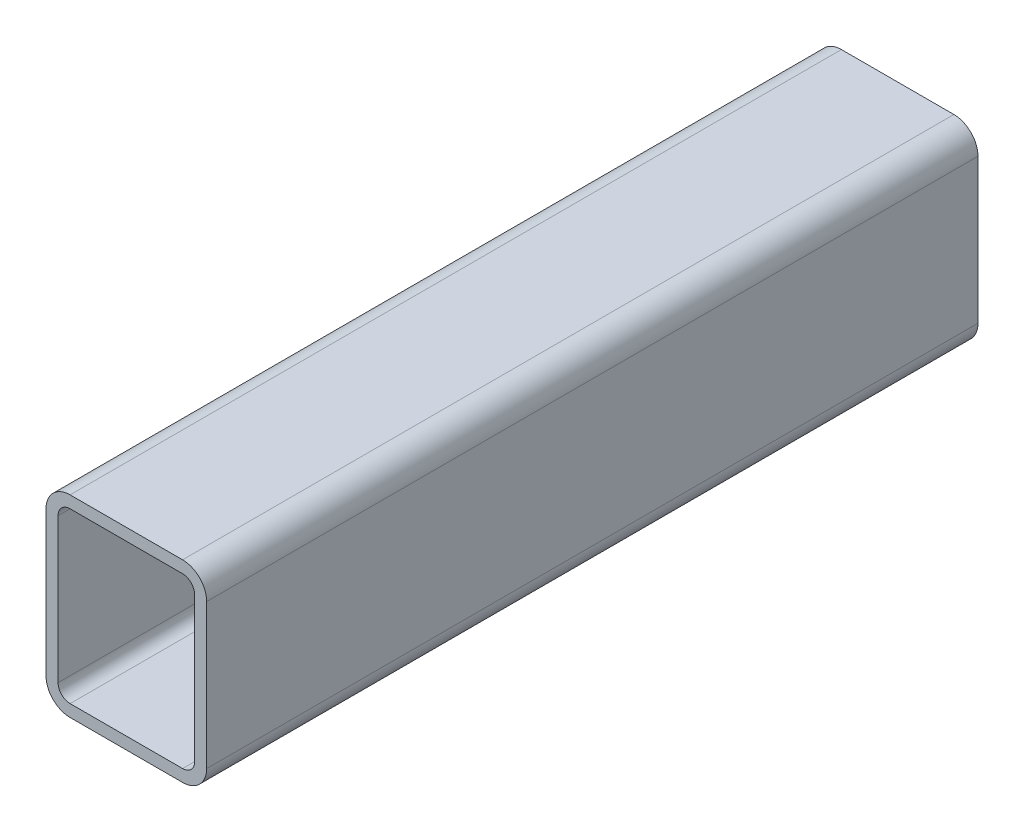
ISO-10303-21;
HEADER;
FILE_DESCRIPTION(('STEP AP214'),'2;1');
FILE_NAME('part.step','',(''),(''),'','','');
FILE_SCHEMA(('AUTOMOTIVE_DESIGN { 1 0 10303 214 1 1 1 1 }'));
ENDSEC;
DATA;
#1=APPLICATION_CONTEXT('core data for automotive mechanical design processes');
#2=APPLICATION_PROTOCOL_DEFINITION('international standard','automotive_design',2000,#1);
#3=PRODUCT_CONTEXT('',#1,'mechanical');
#4=PRODUCT('Part','Part','',(#3));
#5=PRODUCT_RELATED_PRODUCT_CATEGORY('part','',(#4));
#6=PRODUCT_DEFINITION_FORMATION('','',#4);
#7=PRODUCT_DEFINITION_CONTEXT('part definition',#1,'design');
#8=PRODUCT_DEFINITION('design','',#6,#7);
#9=PRODUCT_DEFINITION_SHAPE('','',#8);
#10=(LENGTH_UNIT() NAMED_UNIT(*) SI_UNIT(.MILLI.,.METRE.));
#11=(NAMED_UNIT(*) PLANE_ANGLE_UNIT() SI_UNIT($,.RADIAN.));
#12=(NAMED_UNIT(*) SI_UNIT($,.STERADIAN.) SOLID_ANGLE_UNIT());
#13=UNCERTAINTY_MEASURE_WITH_UNIT(LENGTH_MEASURE(1.E-05),#10,'distance_accuracy_value','');
#14=(GEOMETRIC_REPRESENTATION_CONTEXT(3) GLOBAL_UNCERTAINTY_ASSIGNED_CONTEXT((#13)) GLOBAL_UNIT_ASSIGNED_CONTEXT((#10,
#11,#12)) REPRESENTATION_CONTEXT('',''));
#15=CARTESIAN_POINT('',(0.,0.,0.));
#16=DIRECTION('',(0.,0.,1.));
#17=DIRECTION('',(1.,0.,0.));
#18=AXIS2_PLACEMENT_3D('',#15,#16,#17);
#19=CARTESIAN_POINT('',(12.4210851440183,68.7556737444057,304.8));
#20=DIRECTION('',(0.,0.,1.));
#21=DIRECTION('',(1.,0.,0.));
#22=AXIS2_PLACEMENT_3D('',#19,#20,#21);
#23=PLANE('',#22);
#24=CARTESIAN_POINT('',(12.4210851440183,68.7556737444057,304.8));
#25=DIRECTION('',(0.,0.,1.));
#26=DIRECTION('',(1.,0.,0.));
#27=AXIS2_PLACEMENT_3D('',#24,#25,#26);
#28=CIRCLE('',#27,9.525);
#29=CARTESIAN_POINT('',(12.4210851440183,78.2806737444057,304.8));
#30=VERTEX_POINT('',#29);
#31=CARTESIAN_POINT('',(2.89608514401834,68.7556737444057,304.8));
#32=VERTEX_POINT('',#31);
#33=EDGE_CURVE('E211',#30,#32,#28,.T.);
#34=ORIENTED_EDGE('',*,*,#33,.T.);
#35=DIRECTION('',(0.,-1.,0.));
#36=VECTOR('',#35,1.);
#37=CARTESIAN_POINT('',(2.89608514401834,11.6056737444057,304.8));
#38=LINE('',#37,#36);
#39=CARTESIAN_POINT('',(2.89608514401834,11.6056737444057,304.8));
#40=VERTEX_POINT('',#39);
#41=EDGE_CURVE('E214',#32,#40,#38,.T.);
#42=ORIENTED_EDGE('',*,*,#41,.T.);
#43=CARTESIAN_POINT('',(12.4210851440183,11.6056737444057,304.8));
#44=DIRECTION('',(0.,0.,1.));
#45=DIRECTION('',(1.,0.,0.));
#46=AXIS2_PLACEMENT_3D('',#43,#44,#45);
#47=CIRCLE('',#46,9.525);
#48=CARTESIAN_POINT('',(12.4210851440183,2.0806737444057,304.8));
#49=VERTEX_POINT('',#48);
#50=EDGE_CURVE('E217',#40,#49,#47,.T.);
#51=ORIENTED_EDGE('',*,*,#50,.T.);
#52=DIRECTION('',(1.,0.,0.));
#53=VECTOR('',#52,1.);
#54=CARTESIAN_POINT('',(56.8710851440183,2.0806737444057,304.8));
#55=LINE('',#54,#53);
#56=CARTESIAN_POINT('',(56.8710851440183,2.0806737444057,304.8));
#57=VERTEX_POINT('',#56);
#58=EDGE_CURVE('E219',#49,#57,#55,.T.);
#59=ORIENTED_EDGE('',*,*,#58,.T.);
#60=CARTESIAN_POINT('',(56.8710851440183,11.6056737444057,304.8));
#61=DIRECTION('',(0.,0.,1.));
#62=DIRECTION('',(1.,0.,0.));
#63=AXIS2_PLACEMENT_3D('',#60,#61,#62);
#64=CIRCLE('',#63,9.525);
#65=CARTESIAN_POINT('',(66.3960851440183,11.6056737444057,304.8));
#66=VERTEX_POINT('',#65);
#67=EDGE_CURVE('E221',#57,#66,#64,.T.);
#68=ORIENTED_EDGE('',*,*,#67,.T.);
#69=DIRECTION('',(0.,1.,0.));
#70=VECTOR('',#69,1.);
#71=CARTESIAN_POINT('',(66.3960851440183,68.7556737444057,304.8));
#72=LINE('',#71,#70);
#73=CARTESIAN_POINT('',(66.3960851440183,68.7556737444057,304.8));
#74=VERTEX_POINT('',#73);
#75=EDGE_CURVE('E223',#66,#74,#72,.T.);
#76=ORIENTED_EDGE('',*,*,#75,.T.);
#77=CARTESIAN_POINT('',(56.8710851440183,68.7556737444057,304.8));
#78=DIRECTION('',(0.,0.,1.));
#79=DIRECTION('',(1.,0.,0.));
#80=AXIS2_PLACEMENT_3D('',#77,#78,#79);
#81=CIRCLE('',#80,9.525);
#82=CARTESIAN_POINT('',(56.8710851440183,78.2806737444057,304.8));
#83=VERTEX_POINT('',#82);
#84=EDGE_CURVE('E225',#74,#83,#81,.T.);
#85=ORIENTED_EDGE('',*,*,#84,.T.);
#86=DIRECTION('',(-1.,0.,0.));
#87=VECTOR('',#86,1.);
#88=CARTESIAN_POINT('',(12.4210851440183,78.2806737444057,304.8));
#89=LINE('',#88,#87);
#90=EDGE_CURVE('E227',#83,#30,#89,.T.);
#91=ORIENTED_EDGE('',*,*,#90,.T.);
#92=EDGE_LOOP('',(#34,#42,#51,#59,#68,#76,#85,#91));
#93=FACE_BOUND('',#92,.T.);
#94=DIRECTION('',(0.,-1.,0.));
#95=VECTOR('',#94,1.);
#96=CARTESIAN_POINT('',(7.65858514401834,11.6056737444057,304.8));
#97=LINE('',#96,#95);
#98=CARTESIAN_POINT('',(7.65858514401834,68.7556737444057,304.8));
#99=VERTEX_POINT('',#98);
#100=CARTESIAN_POINT('',(7.65858514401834,11.6056737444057,304.8));
#101=VERTEX_POINT('',#100);
#102=EDGE_CURVE('E154',#99,#101,#97,.T.);
#103=ORIENTED_EDGE('',*,*,#102,.F.);
#104=CARTESIAN_POINT('',(12.4210851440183,68.7556737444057,304.8));
#105=DIRECTION('',(0.,0.,1.));
#106=DIRECTION('',(1.,0.,0.));
#107=AXIS2_PLACEMENT_3D('',#104,#105,#106);
#108=CIRCLE('',#107,4.76249999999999);
#109=CARTESIAN_POINT('',(12.4210851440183,73.5181737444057,304.8));
#110=VERTEX_POINT('',#109);
#111=EDGE_CURVE('E146',#110,#99,#108,.T.);
#112=ORIENTED_EDGE('',*,*,#111,.F.);
#113=DIRECTION('',(-1.,0.,0.));
#114=VECTOR('',#113,1.);
#115=CARTESIAN_POINT('',(12.4210851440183,73.5181737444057,304.8));
#116=LINE('',#115,#114);
#117=CARTESIAN_POINT('',(56.8710851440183,73.5181737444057,304.8));
#118=VERTEX_POINT('',#117);
#119=EDGE_CURVE('E179',#118,#110,#116,.T.);
#120=ORIENTED_EDGE('',*,*,#119,.F.);
#121=CARTESIAN_POINT('',(56.8710851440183,68.7556737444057,304.8));
#122=DIRECTION('',(0.,0.,1.));
#123=DIRECTION('',(1.,0.,0.));
#124=AXIS2_PLACEMENT_3D('',#121,#122,#123);
#125=CIRCLE('',#124,4.7625);
#126=CARTESIAN_POINT('',(61.6335851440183,68.7556737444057,304.8));
#127=VERTEX_POINT('',#126);
#128=EDGE_CURVE('E177',#127,#118,#125,.T.);
#129=ORIENTED_EDGE('',*,*,#128,.F.);
#130=DIRECTION('',(0.,1.,0.));
#131=VECTOR('',#130,1.);
#132=CARTESIAN_POINT('',(61.6335851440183,68.7556737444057,304.8));
#133=LINE('',#132,#131);
#134=CARTESIAN_POINT('',(61.6335851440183,11.6056737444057,304.8));
#135=VERTEX_POINT('',#134);
#136=EDGE_CURVE('E175',#135,#127,#133,.T.);
#137=ORIENTED_EDGE('',*,*,#136,.F.);
#138=CARTESIAN_POINT('',(56.8710851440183,11.6056737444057,304.8));
#139=DIRECTION('',(0.,0.,1.));
#140=DIRECTION('',(1.,0.,0.));
#141=AXIS2_PLACEMENT_3D('',#138,#139,#140);
#142=CIRCLE('',#141,4.7625);
#143=CARTESIAN_POINT('',(56.8710851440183,6.8431737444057,304.8));
#144=VERTEX_POINT('',#143);
#145=EDGE_CURVE('E173',#144,#135,#142,.T.);
#146=ORIENTED_EDGE('',*,*,#145,.F.);
#147=DIRECTION('',(1.,0.,0.));
#148=VECTOR('',#147,1.);
#149=CARTESIAN_POINT('',(56.8710851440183,6.8431737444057,304.8));
#150=LINE('',#149,#148);
#151=CARTESIAN_POINT('',(12.4210851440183,6.8431737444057,304.8));
#152=VERTEX_POINT('',#151);
#153=EDGE_CURVE('E169',#152,#144,#150,.T.);
#154=ORIENTED_EDGE('',*,*,#153,.F.);
#155=CARTESIAN_POINT('',(12.4210851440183,11.6056737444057,304.8));
#156=DIRECTION('',(0.,0.,1.));
#157=DIRECTION('',(1.,0.,0.));
#158=AXIS2_PLACEMENT_3D('',#155,#156,#157);
#159=CIRCLE('',#158,4.7625);
#160=EDGE_CURVE('E167',#101,#152,#159,.T.);
#161=ORIENTED_EDGE('',*,*,#160,.F.);
#162=EDGE_LOOP('',(#103,#112,#120,#129,#137,#146,#154,#161));
#163=FACE_BOUND('',#162,.T.);
#164=ADVANCED_FACE('F33',(#93,#163),#23,.T.);
#165=CARTESIAN_POINT('',(12.4210851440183,68.7556737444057,0.));
#166=DIRECTION('',(0.,0.,1.));
#167=DIRECTION('',(1.,0.,0.));
#168=AXIS2_PLACEMENT_3D('',#165,#166,#167);
#169=PLANE('',#168);
#170=CARTESIAN_POINT('',(12.4210851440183,68.7556737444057,0.));
#171=DIRECTION('',(0.,0.,1.));
#172=DIRECTION('',(1.,0.,0.));
#173=AXIS2_PLACEMENT_3D('',#170,#171,#172);
#174=CIRCLE('',#173,9.525);
#175=CARTESIAN_POINT('',(12.4210851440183,78.2806737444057,0.));
#176=VERTEX_POINT('',#175);
#177=CARTESIAN_POINT('',(2.89608514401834,68.7556737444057,0.));
#178=VERTEX_POINT('',#177);
#179=EDGE_CURVE('E162',#176,#178,#174,.T.);
#180=ORIENTED_EDGE('',*,*,#179,.F.);
#181=DIRECTION('',(-1.,0.,0.));
#182=VECTOR('',#181,1.);
#183=CARTESIAN_POINT('',(12.4210851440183,78.2806737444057,0.));
#184=LINE('',#183,#182);
#185=CARTESIAN_POINT('',(56.8710851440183,78.2806737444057,0.));
#186=VERTEX_POINT('',#185);
#187=EDGE_CURVE('E215',#186,#176,#184,.T.);
#188=ORIENTED_EDGE('',*,*,#187,.F.);
#189=CARTESIAN_POINT('',(56.8710851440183,68.7556737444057,0.));
#190=DIRECTION('',(0.,0.,1.));
#191=DIRECTION('',(1.,0.,0.));
#192=AXIS2_PLACEMENT_3D('',#189,#190,#191);
#193=CIRCLE('',#192,9.525);
#194=CARTESIAN_POINT('',(66.3960851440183,68.7556737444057,0.));
#195=VERTEX_POINT('',#194);
#196=EDGE_CURVE('E242',#195,#186,#193,.T.);
#197=ORIENTED_EDGE('',*,*,#196,.F.);
#198=DIRECTION('',(0.,1.,0.));
#199=VECTOR('',#198,1.);
#200=CARTESIAN_POINT('',(66.3960851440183,68.7556737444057,0.));
#201=LINE('',#200,#199);
#202=CARTESIAN_POINT('',(66.3960851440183,11.6056737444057,0.));
#203=VERTEX_POINT('',#202);
#204=EDGE_CURVE('E240',#203,#195,#201,.T.);
#205=ORIENTED_EDGE('',*,*,#204,.F.);
#206=CARTESIAN_POINT('',(56.8710851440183,11.6056737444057,0.));
#207=DIRECTION('',(0.,0.,1.));
#208=DIRECTION('',(1.,0.,0.));
#209=AXIS2_PLACEMENT_3D('',#206,#207,#208);
#210=CIRCLE('',#209,9.525);
#211=CARTESIAN_POINT('',(56.8710851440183,2.0806737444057,0.));
#212=VERTEX_POINT('',#211);
#213=EDGE_CURVE('E238',#212,#203,#210,.T.);
#214=ORIENTED_EDGE('',*,*,#213,.F.);
#215=DIRECTION('',(1.,0.,0.));
#216=VECTOR('',#215,1.);
#217=CARTESIAN_POINT('',(56.8710851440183,2.0806737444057,0.));
#218=LINE('',#217,#216);
#219=CARTESIAN_POINT('',(12.4210851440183,2.0806737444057,0.));
#220=VERTEX_POINT('',#219);
#221=EDGE_CURVE('E236',#220,#212,#218,.T.);
#222=ORIENTED_EDGE('',*,*,#221,.F.);
#223=CARTESIAN_POINT('',(12.4210851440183,11.6056737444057,0.));
#224=DIRECTION('',(0.,0.,1.));
#225=DIRECTION('',(1.,0.,0.));
#226=AXIS2_PLACEMENT_3D('',#223,#224,#225);
#227=CIRCLE('',#226,9.525);
#228=CARTESIAN_POINT('',(2.89608514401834,11.6056737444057,0.));
#229=VERTEX_POINT('',#228);
#230=EDGE_CURVE('E234',#229,#220,#227,.T.);
#231=ORIENTED_EDGE('',*,*,#230,.F.);
#232=DIRECTION('',(0.,-1.,0.));
#233=VECTOR('',#232,1.);
#234=CARTESIAN_POINT('',(2.89608514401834,11.6056737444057,0.));
#235=LINE('',#234,#233);
#236=EDGE_CURVE('E232',#178,#229,#235,.T.);
#237=ORIENTED_EDGE('',*,*,#236,.F.);
#238=EDGE_LOOP('',(#180,#188,#197,#205,#214,#222,#231,#237));
#239=FACE_BOUND('',#238,.T.);
#240=CARTESIAN_POINT('',(12.4210851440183,68.7556737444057,0.));
#241=DIRECTION('',(0.,0.,1.));
#242=DIRECTION('',(1.,0.,0.));
#243=AXIS2_PLACEMENT_3D('',#240,#241,#242);
#244=CIRCLE('',#243,4.76249999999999);
#245=CARTESIAN_POINT('',(12.4210851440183,73.5181737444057,0.));
#246=VERTEX_POINT('',#245);
#247=CARTESIAN_POINT('',(7.65858514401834,68.7556737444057,0.));
#248=VERTEX_POINT('',#247);
#249=EDGE_CURVE('E56',#246,#248,#244,.T.);
#250=ORIENTED_EDGE('',*,*,#249,.T.);
#251=DIRECTION('',(0.,-1.,0.));
#252=VECTOR('',#251,1.);
#253=CARTESIAN_POINT('',(7.65858514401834,11.6056737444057,0.));
#254=LINE('',#253,#252);
#255=CARTESIAN_POINT('',(7.65858514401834,11.6056737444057,0.));
#256=VERTEX_POINT('',#255);
#257=EDGE_CURVE('E161',#248,#256,#254,.T.);
#258=ORIENTED_EDGE('',*,*,#257,.T.);
#259=CARTESIAN_POINT('',(12.4210851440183,11.6056737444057,0.));
#260=DIRECTION('',(0.,0.,1.));
#261=DIRECTION('',(1.,0.,0.));
#262=AXIS2_PLACEMENT_3D('',#259,#260,#261);
#263=CIRCLE('',#262,4.7625);
#264=CARTESIAN_POINT('',(12.4210851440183,6.8431737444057,0.));
#265=VERTEX_POINT('',#264);
#266=EDGE_CURVE('E183',#256,#265,#263,.T.);
#267=ORIENTED_EDGE('',*,*,#266,.T.);
#268=DIRECTION('',(1.,0.,0.));
#269=VECTOR('',#268,1.);
#270=CARTESIAN_POINT('',(56.8710851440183,6.8431737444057,0.));
#271=LINE('',#270,#269);
#272=CARTESIAN_POINT('',(56.8710851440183,6.8431737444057,0.));
#273=VERTEX_POINT('',#272);
#274=EDGE_CURVE('E186',#265,#273,#271,.T.);
#275=ORIENTED_EDGE('',*,*,#274,.T.);
#276=CARTESIAN_POINT('',(56.8710851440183,11.6056737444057,0.));
#277=DIRECTION('',(0.,0.,1.));
#278=DIRECTION('',(1.,0.,0.));
#279=AXIS2_PLACEMENT_3D('',#276,#277,#278);
#280=CIRCLE('',#279,4.7625);
#281=CARTESIAN_POINT('',(61.6335851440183,11.6056737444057,0.));
#282=VERTEX_POINT('',#281);
#283=EDGE_CURVE('E189',#273,#282,#280,.T.);
#284=ORIENTED_EDGE('',*,*,#283,.T.);
#285=DIRECTION('',(0.,1.,0.));
#286=VECTOR('',#285,1.);
#287=CARTESIAN_POINT('',(61.6335851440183,68.7556737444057,0.));
#288=LINE('',#287,#286);
#289=CARTESIAN_POINT('',(61.6335851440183,68.7556737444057,0.));
#290=VERTEX_POINT('',#289);
#291=EDGE_CURVE('E192',#282,#290,#288,.T.);
#292=ORIENTED_EDGE('',*,*,#291,.T.);
#293=CARTESIAN_POINT('',(56.8710851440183,68.7556737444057,0.));
#294=DIRECTION('',(0.,0.,1.));
#295=DIRECTION('',(1.,0.,0.));
#296=AXIS2_PLACEMENT_3D('',#293,#294,#295);
#297=CIRCLE('',#296,4.7625);
#298=CARTESIAN_POINT('',(56.8710851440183,73.5181737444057,0.));
#299=VERTEX_POINT('',#298);
#300=EDGE_CURVE('E195',#290,#299,#297,.T.);
#301=ORIENTED_EDGE('',*,*,#300,.T.);
#302=DIRECTION('',(-1.,0.,0.));
#303=VECTOR('',#302,1.);
#304=CARTESIAN_POINT('',(12.4210851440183,73.5181737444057,0.));
#305=LINE('',#304,#303);
#306=EDGE_CURVE('E155',#299,#246,#305,.T.);
#307=ORIENTED_EDGE('',*,*,#306,.T.);
#308=EDGE_LOOP('',(#250,#258,#267,#275,#284,#292,#301,#307));
#309=FACE_BOUND('',#308,.T.);
#310=ADVANCED_FACE('F272',(#239,#309),#169,.F.);
#311=CARTESIAN_POINT('',(12.4210851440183,68.7556737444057,304.8));
#312=DIRECTION('',(0.,0.,-1.));
#313=DIRECTION('',(-1.,0.,0.));
#314=AXIS2_PLACEMENT_3D('',#311,#312,#313);
#315=CYLINDRICAL_SURFACE('',#314,9.525);
#316=ORIENTED_EDGE('',*,*,#179,.T.);
#317=DIRECTION('',(0.,0.,-1.));
#318=VECTOR('',#317,1.);
#319=CARTESIAN_POINT('',(2.89608514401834,68.7556737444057,304.8));
#320=LINE('',#319,#318);
#321=EDGE_CURVE('E11',#32,#178,#320,.T.);
#322=ORIENTED_EDGE('',*,*,#321,.F.);
#323=ORIENTED_EDGE('',*,*,#33,.F.);
#324=DIRECTION('',(0.,0.,-1.));
#325=VECTOR('',#324,1.);
#326=CARTESIAN_POINT('',(12.4210851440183,78.2806737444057,304.8));
#327=LINE('',#326,#325);
#328=EDGE_CURVE('E229',#30,#176,#327,.T.);
#329=ORIENTED_EDGE('',*,*,#328,.T.);
#330=EDGE_LOOP('',(#316,#322,#323,#329));
#331=FACE_BOUND('',#330,.T.);
#332=ADVANCED_FACE('F35',(#331),#315,.T.);
#333=CARTESIAN_POINT('',(2.89608514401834,11.6056737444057,304.8));
#334=DIRECTION('',(1.,0.,0.));
#335=DIRECTION('',(0.,0.,-1.));
#336=AXIS2_PLACEMENT_3D('',#333,#334,#335);
#337=PLANE('',#336);
#338=ORIENTED_EDGE('',*,*,#236,.T.);
#339=DIRECTION('',(0.,0.,-1.));
#340=VECTOR('',#339,1.);
#341=CARTESIAN_POINT('',(2.89608514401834,11.6056737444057,304.8));
#342=LINE('',#341,#340);
#343=EDGE_CURVE('E41',#40,#229,#342,.T.);
#344=ORIENTED_EDGE('',*,*,#343,.F.);
#345=ORIENTED_EDGE('',*,*,#41,.F.);
#346=ORIENTED_EDGE('',*,*,#321,.T.);
#347=EDGE_LOOP('',(#338,#344,#345,#346));
#348=FACE_BOUND('',#347,.T.);
#349=ADVANCED_FACE('F289',(#348),#337,.F.);
#350=CARTESIAN_POINT('',(12.4210851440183,11.6056737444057,304.8));
#351=DIRECTION('',(0.,0.,-1.));
#352=DIRECTION('',(-1.,0.,0.));
#353=AXIS2_PLACEMENT_3D('',#350,#351,#352);
#354=CYLINDRICAL_SURFACE('',#353,9.525);
#355=ORIENTED_EDGE('',*,*,#230,.T.);
#356=DIRECTION('',(0.,0.,-1.));
#357=VECTOR('',#356,1.);
#358=CARTESIAN_POINT('',(12.4210851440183,2.0806737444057,304.8));
#359=LINE('',#358,#357);
#360=EDGE_CURVE('E259',#49,#220,#359,.T.);
#361=ORIENTED_EDGE('',*,*,#360,.F.);
#362=ORIENTED_EDGE('',*,*,#50,.F.);
#363=ORIENTED_EDGE('',*,*,#343,.T.);
#364=EDGE_LOOP('',(#355,#361,#362,#363));
#365=FACE_BOUND('',#364,.T.);
#366=ADVANCED_FACE('F266',(#365),#354,.T.);
#367=CARTESIAN_POINT('',(56.8710851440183,2.0806737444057,304.8));
#368=DIRECTION('',(0.,1.,0.));
#369=DIRECTION('',(0.,0.,1.));
#370=AXIS2_PLACEMENT_3D('',#367,#368,#369);
#371=PLANE('',#370);
#372=ORIENTED_EDGE('',*,*,#221,.T.);
#373=DIRECTION('',(0.,0.,-1.));
#374=VECTOR('',#373,1.);
#375=CARTESIAN_POINT('',(56.8710851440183,2.0806737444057,304.8));
#376=LINE('',#375,#374);
#377=EDGE_CURVE('E256',#57,#212,#376,.T.);
#378=ORIENTED_EDGE('',*,*,#377,.F.);
#379=ORIENTED_EDGE('',*,*,#58,.F.);
#380=ORIENTED_EDGE('',*,*,#360,.T.);
#381=EDGE_LOOP('',(#372,#378,#379,#380));
#382=FACE_BOUND('',#381,.T.);
#383=ADVANCED_FACE('F278',(#382),#371,.F.);
#384=CARTESIAN_POINT('',(56.8710851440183,11.6056737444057,304.8));
#385=DIRECTION('',(0.,0.,-1.));
#386=DIRECTION('',(-1.,0.,0.));
#387=AXIS2_PLACEMENT_3D('',#384,#385,#386);
#388=CYLINDRICAL_SURFACE('',#387,9.525);
#389=ORIENTED_EDGE('',*,*,#213,.T.);
#390=DIRECTION('',(0.,0.,-1.));
#391=VECTOR('',#390,1.);
#392=CARTESIAN_POINT('',(66.3960851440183,11.6056737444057,304.8));
#393=LINE('',#392,#391);
#394=EDGE_CURVE('E253',#66,#203,#393,.T.);
#395=ORIENTED_EDGE('',*,*,#394,.F.);
#396=ORIENTED_EDGE('',*,*,#67,.F.);
#397=ORIENTED_EDGE('',*,*,#377,.T.);
#398=EDGE_LOOP('',(#389,#395,#396,#397));
#399=FACE_BOUND('',#398,.T.);
#400=ADVANCED_FACE('F282',(#399),#388,.T.);
#401=CARTESIAN_POINT('',(66.3960851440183,68.7556737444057,304.8));
#402=DIRECTION('',(-1.,0.,0.));
#403=DIRECTION('',(0.,0.,1.));
#404=AXIS2_PLACEMENT_3D('',#401,#402,#403);
#405=PLANE('',#404);
#406=ORIENTED_EDGE('',*,*,#204,.T.);
#407=DIRECTION('',(0.,0.,-1.));
#408=VECTOR('',#407,1.);
#409=CARTESIAN_POINT('',(66.3960851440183,68.7556737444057,304.8));
#410=LINE('',#409,#408);
#411=EDGE_CURVE('E250',#74,#195,#410,.T.);
#412=ORIENTED_EDGE('',*,*,#411,.F.);
#413=ORIENTED_EDGE('',*,*,#75,.F.);
#414=ORIENTED_EDGE('',*,*,#394,.T.);
#415=EDGE_LOOP('',(#406,#412,#413,#414));
#416=FACE_BOUND('',#415,.T.);
#417=ADVANCED_FACE('F302',(#416),#405,.F.);
#418=CARTESIAN_POINT('',(56.8710851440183,68.7556737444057,304.8));
#419=DIRECTION('',(0.,0.,-1.));
#420=DIRECTION('',(-1.,0.,0.));
#421=AXIS2_PLACEMENT_3D('',#418,#419,#420);
#422=CYLINDRICAL_SURFACE('',#421,9.525);
#423=ORIENTED_EDGE('',*,*,#196,.T.);
#424=DIRECTION('',(0.,0.,-1.));
#425=VECTOR('',#424,1.);
#426=CARTESIAN_POINT('',(56.8710851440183,78.2806737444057,304.8));
#427=LINE('',#426,#425);
#428=EDGE_CURVE('E247',#83,#186,#427,.T.);
#429=ORIENTED_EDGE('',*,*,#428,.F.);
#430=ORIENTED_EDGE('',*,*,#84,.F.);
#431=ORIENTED_EDGE('',*,*,#411,.T.);
#432=EDGE_LOOP('',(#423,#429,#430,#431));
#433=FACE_BOUND('',#432,.T.);
#434=ADVANCED_FACE('F300',(#433),#422,.T.);
#435=CARTESIAN_POINT('',(12.4210851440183,78.2806737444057,304.8));
#436=DIRECTION('',(0.,-1.,0.));
#437=DIRECTION('',(0.,0.,-1.));
#438=AXIS2_PLACEMENT_3D('',#435,#436,#437);
#439=PLANE('',#438);
#440=ORIENTED_EDGE('',*,*,#187,.T.);
#441=ORIENTED_EDGE('',*,*,#328,.F.);
#442=ORIENTED_EDGE('',*,*,#90,.F.);
#443=ORIENTED_EDGE('',*,*,#428,.T.);
#444=EDGE_LOOP('',(#440,#441,#442,#443));
#445=FACE_BOUND('',#444,.T.);
#446=ADVANCED_FACE('F295',(#445),#439,.F.);
#447=CARTESIAN_POINT('',(12.4210851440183,68.7556737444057,304.8));
#448=DIRECTION('',(0.,0.,-1.));
#449=DIRECTION('',(-1.,0.,0.));
#450=AXIS2_PLACEMENT_3D('',#447,#448,#449);
#451=CYLINDRICAL_SURFACE('',#450,4.76249999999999);
#452=ORIENTED_EDGE('',*,*,#249,.F.);
#453=DIRECTION('',(0.,0.,-1.));
#454=VECTOR('',#453,1.);
#455=CARTESIAN_POINT('',(12.4210851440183,73.5181737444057,304.8));
#456=LINE('',#455,#454);
#457=EDGE_CURVE('E150',#110,#246,#456,.T.);
#458=ORIENTED_EDGE('',*,*,#457,.F.);
#459=ORIENTED_EDGE('',*,*,#111,.T.);
#460=DIRECTION('',(0.,0.,-1.));
#461=VECTOR('',#460,1.);
#462=CARTESIAN_POINT('',(7.65858514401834,68.7556737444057,304.8));
#463=LINE('',#462,#461);
#464=EDGE_CURVE('E149',#99,#248,#463,.T.);
#465=ORIENTED_EDGE('',*,*,#464,.T.);
#466=EDGE_LOOP('',(#452,#458,#459,#465));
#467=FACE_BOUND('',#466,.T.);
#468=ADVANCED_FACE('F148',(#467),#451,.F.);
#469=CARTESIAN_POINT('',(7.65858514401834,11.6056737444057,304.8));
#470=DIRECTION('',(1.,0.,0.));
#471=DIRECTION('',(0.,0.,-1.));
#472=AXIS2_PLACEMENT_3D('',#469,#470,#471);
#473=PLANE('',#472);
#474=ORIENTED_EDGE('',*,*,#257,.F.);
#475=ORIENTED_EDGE('',*,*,#464,.F.);
#476=ORIENTED_EDGE('',*,*,#102,.T.);
#477=DIRECTION('',(0.,0.,-1.));
#478=VECTOR('',#477,1.);
#479=CARTESIAN_POINT('',(7.65858514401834,11.6056737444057,304.8));
#480=LINE('',#479,#478);
#481=EDGE_CURVE('E163',#101,#256,#480,.T.);
#482=ORIENTED_EDGE('',*,*,#481,.T.);
#483=EDGE_LOOP('',(#474,#475,#476,#482));
#484=FACE_BOUND('',#483,.T.);
#485=ADVANCED_FACE('F158',(#484),#473,.T.);
#486=CARTESIAN_POINT('',(12.4210851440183,11.6056737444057,304.8));
#487=DIRECTION('',(0.,0.,-1.));
#488=DIRECTION('',(-1.,0.,0.));
#489=AXIS2_PLACEMENT_3D('',#486,#487,#488);
#490=CYLINDRICAL_SURFACE('',#489,4.7625);
#491=ORIENTED_EDGE('',*,*,#266,.F.);
#492=ORIENTED_EDGE('',*,*,#481,.F.);
#493=ORIENTED_EDGE('',*,*,#160,.T.);
#494=DIRECTION('',(0.,0.,-1.));
#495=VECTOR('',#494,1.);
#496=CARTESIAN_POINT('',(12.4210851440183,6.8431737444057,304.8));
#497=LINE('',#496,#495);
#498=EDGE_CURVE('E208',#152,#265,#497,.T.);
#499=ORIENTED_EDGE('',*,*,#498,.T.);
#500=EDGE_LOOP('',(#491,#492,#493,#499));
#501=FACE_BOUND('',#500,.T.);
#502=ADVANCED_FACE('F327',(#501),#490,.F.);
#503=CARTESIAN_POINT('',(56.8710851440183,6.8431737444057,304.8));
#504=DIRECTION('',(0.,1.,0.));
#505=DIRECTION('',(0.,0.,1.));
#506=AXIS2_PLACEMENT_3D('',#503,#504,#505);
#507=PLANE('',#506);
#508=ORIENTED_EDGE('',*,*,#274,.F.);
#509=ORIENTED_EDGE('',*,*,#498,.F.);
#510=ORIENTED_EDGE('',*,*,#153,.T.);
#511=DIRECTION('',(0.,0.,-1.));
#512=VECTOR('',#511,1.);
#513=CARTESIAN_POINT('',(56.8710851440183,6.8431737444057,304.8));
#514=LINE('',#513,#512);
#515=EDGE_CURVE('E206',#144,#273,#514,.T.);
#516=ORIENTED_EDGE('',*,*,#515,.T.);
#517=EDGE_LOOP('',(#508,#509,#510,#516));
#518=FACE_BOUND('',#517,.T.);
#519=ADVANCED_FACE('F331',(#518),#507,.T.);
#520=CARTESIAN_POINT('',(56.8710851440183,11.6056737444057,304.8));
#521=DIRECTION('',(0.,0.,-1.));
#522=DIRECTION('',(-1.,0.,0.));
#523=AXIS2_PLACEMENT_3D('',#520,#521,#522);
#524=CYLINDRICAL_SURFACE('',#523,4.7625);
#525=ORIENTED_EDGE('',*,*,#283,.F.);
#526=ORIENTED_EDGE('',*,*,#515,.F.);
#527=ORIENTED_EDGE('',*,*,#145,.T.);
#528=DIRECTION('',(0.,0.,-1.));
#529=VECTOR('',#528,1.);
#530=CARTESIAN_POINT('',(61.6335851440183,11.6056737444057,304.8));
#531=LINE('',#530,#529);
#532=EDGE_CURVE('E204',#135,#282,#531,.T.);
#533=ORIENTED_EDGE('',*,*,#532,.T.);
#534=EDGE_LOOP('',(#525,#526,#527,#533));
#535=FACE_BOUND('',#534,.T.);
#536=ADVANCED_FACE('F337',(#535),#524,.F.);
#537=CARTESIAN_POINT('',(61.6335851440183,68.7556737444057,304.8));
#538=DIRECTION('',(-1.,0.,0.));
#539=DIRECTION('',(0.,0.,1.));
#540=AXIS2_PLACEMENT_3D('',#537,#538,#539);
#541=PLANE('',#540);
#542=ORIENTED_EDGE('',*,*,#291,.F.);
#543=ORIENTED_EDGE('',*,*,#532,.F.);
#544=ORIENTED_EDGE('',*,*,#136,.T.);
#545=DIRECTION('',(0.,0.,-1.));
#546=VECTOR('',#545,1.);
#547=CARTESIAN_POINT('',(61.6335851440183,68.7556737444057,304.8));
#548=LINE('',#547,#546);
#549=EDGE_CURVE('E202',#127,#290,#548,.T.);
#550=ORIENTED_EDGE('',*,*,#549,.T.);
#551=EDGE_LOOP('',(#542,#543,#544,#550));
#552=FACE_BOUND('',#551,.T.);
#553=ADVANCED_FACE('F341',(#552),#541,.T.);
#554=CARTESIAN_POINT('',(56.8710851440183,68.7556737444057,304.8));
#555=DIRECTION('',(0.,0.,-1.));
#556=DIRECTION('',(-1.,0.,0.));
#557=AXIS2_PLACEMENT_3D('',#554,#555,#556);
#558=CYLINDRICAL_SURFACE('',#557,4.7625);
#559=ORIENTED_EDGE('',*,*,#300,.F.);
#560=ORIENTED_EDGE('',*,*,#549,.F.);
#561=ORIENTED_EDGE('',*,*,#128,.T.);
#562=DIRECTION('',(0.,0.,-1.));
#563=VECTOR('',#562,1.);
#564=CARTESIAN_POINT('',(56.8710851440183,73.5181737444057,304.8));
#565=LINE('',#564,#563);
#566=EDGE_CURVE('E48',#118,#299,#565,.T.);
#567=ORIENTED_EDGE('',*,*,#566,.T.);
#568=EDGE_LOOP('',(#559,#560,#561,#567));
#569=FACE_BOUND('',#568,.T.);
#570=ADVANCED_FACE('F345',(#569),#558,.F.);
#571=CARTESIAN_POINT('',(12.4210851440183,73.5181737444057,304.8));
#572=DIRECTION('',(0.,-1.,0.));
#573=DIRECTION('',(0.,0.,-1.));
#574=AXIS2_PLACEMENT_3D('',#571,#572,#573);
#575=PLANE('',#574);
#576=ORIENTED_EDGE('',*,*,#306,.F.);
#577=ORIENTED_EDGE('',*,*,#566,.F.);
#578=ORIENTED_EDGE('',*,*,#119,.T.);
#579=ORIENTED_EDGE('',*,*,#457,.T.);
#580=EDGE_LOOP('',(#576,#577,#578,#579));
#581=FACE_BOUND('',#580,.T.);
#582=ADVANCED_FACE('F349',(#581),#575,.T.);
#583=CLOSED_SHELL('',(#164,#310,#332,#349,#366,#383,#400,#417,#434,#446,#468,#485,#502,#519,
#536,#553,#570,#582));
#584=MANIFOLD_SOLID_BREP('B2',#583);
#585=ADVANCED_BREP_SHAPE_REPRESENTATION('',(#18,#584),#14);
#586=SHAPE_DEFINITION_REPRESENTATION(#9,#585);
ENDSEC;
END-ISO-10303-21;
